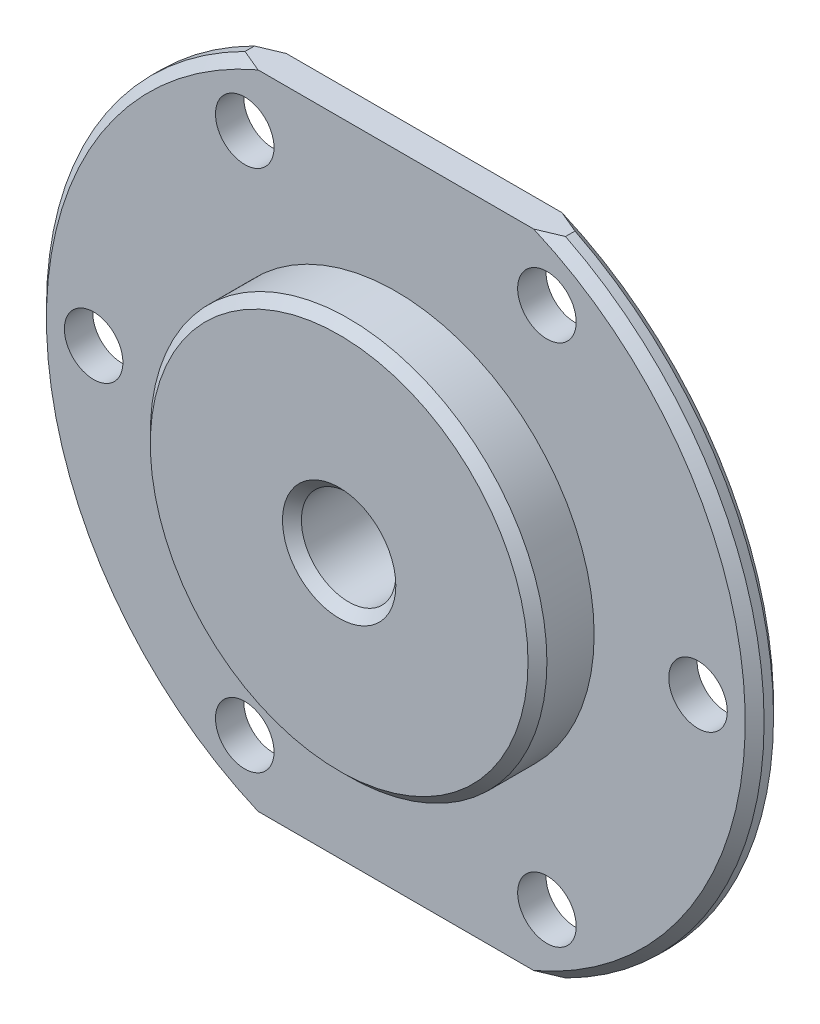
ISO-10303-21;
HEADER;
FILE_DESCRIPTION(('STEP AP214'),'2;1');
FILE_NAME('part.step','',(''),(''),'','','');
FILE_SCHEMA(('AUTOMOTIVE_DESIGN { 1 0 10303 214 1 1 1 1 }'));
ENDSEC;
DATA;
#1=APPLICATION_CONTEXT('core data for automotive mechanical design processes');
#2=APPLICATION_PROTOCOL_DEFINITION('international standard','automotive_design',2000,#1);
#3=PRODUCT_CONTEXT('',#1,'mechanical');
#4=PRODUCT('Part','Part','',(#3));
#5=PRODUCT_RELATED_PRODUCT_CATEGORY('part','',(#4));
#6=PRODUCT_DEFINITION_FORMATION('','',#4);
#7=PRODUCT_DEFINITION_CONTEXT('part definition',#1,'design');
#8=PRODUCT_DEFINITION('design','',#6,#7);
#9=PRODUCT_DEFINITION_SHAPE('','',#8);
#10=(LENGTH_UNIT() NAMED_UNIT(*) SI_UNIT(.MILLI.,.METRE.));
#11=(NAMED_UNIT(*) PLANE_ANGLE_UNIT() SI_UNIT($,.RADIAN.));
#12=(NAMED_UNIT(*) SI_UNIT($,.STERADIAN.) SOLID_ANGLE_UNIT());
#13=UNCERTAINTY_MEASURE_WITH_UNIT(LENGTH_MEASURE(1.E-05),#10,'distance_accuracy_value','');
#14=(GEOMETRIC_REPRESENTATION_CONTEXT(3) GLOBAL_UNCERTAINTY_ASSIGNED_CONTEXT((#13)) GLOBAL_UNIT_ASSIGNED_CONTEXT((#10,
#11,#12)) REPRESENTATION_CONTEXT('',''));
#15=CARTESIAN_POINT('',(0.,0.,0.));
#16=DIRECTION('',(0.,0.,1.));
#17=DIRECTION('',(1.,0.,0.));
#18=AXIS2_PLACEMENT_3D('',#15,#16,#17);
#19=CARTESIAN_POINT('',(0.,0.,1.5));
#20=DIRECTION('',(0.,0.,-1.));
#21=DIRECTION('',(-1.,0.,0.));
#22=AXIS2_PLACEMENT_3D('',#19,#20,#21);
#23=CYLINDRICAL_SURFACE('',#22,18.9998743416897);
#24=DIRECTION('',(0.,0.,-1.));
#25=VECTOR('',#24,1.);
#26=CARTESIAN_POINT('',(-8.48500000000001,17.,1.5));
#27=LINE('',#26,#25);
#28=CARTESIAN_POINT('',(-8.48500000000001,17.,1.00000000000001));
#29=VERTEX_POINT('',#28);
#30=CARTESIAN_POINT('',(-8.48500000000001,17.,0.500000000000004));
#31=VERTEX_POINT('',#30);
#32=EDGE_CURVE('E127',#29,#31,#27,.T.);
#33=ORIENTED_EDGE('',*,*,#32,.T.);
#34=CARTESIAN_POINT('',(0.,0.,0.500000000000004));
#35=DIRECTION('',(0.,0.,1.));
#36=DIRECTION('',(1.,0.,0.));
#37=AXIS2_PLACEMENT_3D('',#34,#35,#36);
#38=CIRCLE('',#37,18.9998743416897);
#39=CARTESIAN_POINT('',(-8.485,-17.,0.500000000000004));
#40=VERTEX_POINT('',#39);
#41=EDGE_CURVE('E240',#31,#40,#38,.T.);
#42=ORIENTED_EDGE('',*,*,#41,.T.);
#43=DIRECTION('',(0.,0.,-1.));
#44=VECTOR('',#43,1.);
#45=CARTESIAN_POINT('',(-8.485,-17.,1.5));
#46=LINE('',#45,#44);
#47=CARTESIAN_POINT('',(-8.485,-17.,1.00000000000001));
#48=VERTEX_POINT('',#47);
#49=EDGE_CURVE('E303',#48,#40,#46,.T.);
#50=ORIENTED_EDGE('',*,*,#49,.F.);
#51=CARTESIAN_POINT('',(0.,0.,1.00000000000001));
#52=DIRECTION('',(0.,0.,1.));
#53=DIRECTION('',(1.,0.,0.));
#54=AXIS2_PLACEMENT_3D('',#51,#52,#53);
#55=CIRCLE('',#54,18.9998743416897);
#56=EDGE_CURVE('E239',#48,#29,#55,.F.);
#57=ORIENTED_EDGE('',*,*,#56,.T.);
#58=EDGE_LOOP('',(#33,#42,#50,#57));
#59=FACE_BOUND('',#58,.T.);
#60=ADVANCED_FACE('F37',(#59),#23,.T.);
#61=CARTESIAN_POINT('',(-8.485,-17.,1.5));
#62=DIRECTION('',(0.,1.,0.));
#63=DIRECTION('',(-1.,0.,0.));
#64=AXIS2_PLACEMENT_3D('',#61,#62,#63);
#65=PLANE('',#64);
#66=DIRECTION('',(1.,0.,0.));
#67=VECTOR('',#66,1.);
#68=CARTESIAN_POINT('',(-8.485,-17.,0.));
#69=LINE('',#68,#67);
#70=CARTESIAN_POINT('',(-7.29694118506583,-17.,0.));
#71=VERTEX_POINT('',#70);
#72=CARTESIAN_POINT('',(7.29694118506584,-17.,0.));
#73=VERTEX_POINT('',#72);
#74=EDGE_CURVE('E236',#71,#73,#69,.T.);
#75=ORIENTED_EDGE('',*,*,#74,.T.);
#76=CARTESIAN_POINT('',(7.29694118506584,-17.,0.));
#77=CARTESIAN_POINT('',(7.39687946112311,-17.,0.0394189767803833));
#78=CARTESIAN_POINT('',(7.49658395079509,-17.,0.0794293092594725));
#79=CARTESIAN_POINT('',(7.69551600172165,-17.,0.160584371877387));
#80=CARTESIAN_POINT('',(7.79474361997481,-17.,0.201728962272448));
#81=CARTESIAN_POINT('',(7.99273655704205,-17.,0.285113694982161));
#82=CARTESIAN_POINT('',(8.09150187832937,-17.,0.327353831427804));
#83=CARTESIAN_POINT('',(8.28858707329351,-17.,0.412893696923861));
#84=CARTESIAN_POINT('',(8.38690689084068,-17.,0.456193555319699));
#85=CARTESIAN_POINT('',(8.48500000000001,-17.,0.499999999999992));
#86=B_SPLINE_CURVE_WITH_KNOTS('',3,(#76,#77,#78,#79,#80,#81,#82,#83,#84,#85),.UNSPECIFIED.,.F.,
.F.,(4,2,2,2,4),(0.,0.32229172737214,0.644543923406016,0.966794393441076,1.28908439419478),.UNSPECIFIED.);
#87=CARTESIAN_POINT('',(8.485,-17.,0.500000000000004));
#88=VERTEX_POINT('',#87);
#89=EDGE_CURVE('E202',#73,#88,#86,.T.);
#90=ORIENTED_EDGE('',*,*,#89,.T.);
#91=DIRECTION('',(0.,0.,-1.));
#92=VECTOR('',#91,1.);
#93=CARTESIAN_POINT('',(8.485,-17.,1.5));
#94=LINE('',#93,#92);
#95=CARTESIAN_POINT('',(8.485,-17.,1.00000000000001));
#96=VERTEX_POINT('',#95);
#97=EDGE_CURVE('E126',#96,#88,#94,.T.);
#98=ORIENTED_EDGE('',*,*,#97,.F.);
#99=CARTESIAN_POINT('',(8.485,-17.,1.00000000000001));
#100=CARTESIAN_POINT('',(8.38690689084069,-17.,1.04380644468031));
#101=CARTESIAN_POINT('',(8.28858707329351,-17.,1.08710630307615));
#102=CARTESIAN_POINT('',(8.09150187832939,-17.,1.17264616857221));
#103=CARTESIAN_POINT('',(7.99273655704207,-17.,1.21488630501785));
#104=CARTESIAN_POINT('',(7.79474361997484,-17.,1.29827103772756));
#105=CARTESIAN_POINT('',(7.69551600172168,-17.,1.33941562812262));
#106=CARTESIAN_POINT('',(7.49658395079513,-17.,1.42057069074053));
#107=CARTESIAN_POINT('',(7.39687946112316,-17.,1.46058102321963));
#108=CARTESIAN_POINT('',(7.29694118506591,-17.,1.50000000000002));
#109=B_SPLINE_CURVE_WITH_KNOTS('',3,(#99,#100,#101,#102,#103,#104,#105,#106,#107,#108),
.UNSPECIFIED.,.F.,.F.,(4,2,2,2,4),(0.,0.322290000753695,0.644540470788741,0.966792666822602,
1.28908439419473),.UNSPECIFIED.);
#110=CARTESIAN_POINT('',(7.29694118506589,-17.,1.5));
#111=VERTEX_POINT('',#110);
#112=EDGE_CURVE('E131',#96,#111,#109,.T.);
#113=ORIENTED_EDGE('',*,*,#112,.T.);
#114=DIRECTION('',(1.,0.,0.));
#115=VECTOR('',#114,1.);
#116=CARTESIAN_POINT('',(-8.485,-17.,1.5));
#117=LINE('',#116,#115);
#118=CARTESIAN_POINT('',(-7.29694118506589,-17.,1.5));
#119=VERTEX_POINT('',#118);
#120=EDGE_CURVE('E235',#119,#111,#117,.T.);
#121=ORIENTED_EDGE('',*,*,#120,.F.);
#122=CARTESIAN_POINT('',(-7.29694118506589,-17.,1.5));
#123=CARTESIAN_POINT('',(-7.39687946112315,-17.,1.46058102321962));
#124=CARTESIAN_POINT('',(-7.49658395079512,-17.,1.42057069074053));
#125=CARTESIAN_POINT('',(-7.69551600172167,-17.,1.33941562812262));
#126=CARTESIAN_POINT('',(-7.79474361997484,-17.,1.29827103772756));
#127=CARTESIAN_POINT('',(-7.99273655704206,-17.,1.21488630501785));
#128=CARTESIAN_POINT('',(-8.09150187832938,-17.,1.17264616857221));
#129=CARTESIAN_POINT('',(-8.28858707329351,-17.,1.08710630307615));
#130=CARTESIAN_POINT('',(-8.38690689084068,-17.,1.04380644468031));
#131=CARTESIAN_POINT('',(-8.485,-17.,1.00000000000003));
#132=B_SPLINE_CURVE_WITH_KNOTS('',3,(#122,#123,#124,#125,#126,#127,#128,#129,#130,#131),
.UNSPECIFIED.,.F.,.F.,(4,2,2,2,4),(0.,0.322291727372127,0.644543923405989,0.966794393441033,
1.28908439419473),.UNSPECIFIED.);
#133=EDGE_CURVE('E61',#119,#48,#132,.T.);
#134=ORIENTED_EDGE('',*,*,#133,.T.);
#135=ORIENTED_EDGE('',*,*,#49,.T.);
#136=CARTESIAN_POINT('',(-8.485,-17.,0.500000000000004));
#137=CARTESIAN_POINT('',(-8.38690689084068,-17.,0.456193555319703));
#138=CARTESIAN_POINT('',(-8.2885870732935,-17.,0.41289369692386));
#139=CARTESIAN_POINT('',(-8.09150187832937,-17.,0.327353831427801));
#140=CARTESIAN_POINT('',(-7.99273655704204,-17.,0.28511369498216));
#141=CARTESIAN_POINT('',(-7.79474361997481,-17.,0.201728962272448));
#142=CARTESIAN_POINT('',(-7.69551600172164,-17.,0.160584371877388));
#143=CARTESIAN_POINT('',(-7.49658395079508,-17.,0.079429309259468));
#144=CARTESIAN_POINT('',(-7.39687946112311,-17.,0.0394189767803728));
#145=CARTESIAN_POINT('',(-7.29694118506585,-17.,0.));
#146=B_SPLINE_CURVE_WITH_KNOTS('',3,(#136,#137,#138,#139,#140,#141,#142,#143,#144,#145),
.UNSPECIFIED.,.F.,.F.,(4,2,2,2,4),(0.,0.32229000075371,0.64454047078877,0.966792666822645,
1.28908439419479),.UNSPECIFIED.);
#147=EDGE_CURVE('E53',#40,#71,#146,.T.);
#148=ORIENTED_EDGE('',*,*,#147,.T.);
#149=EDGE_LOOP('',(#75,#90,#98,#113,#121,#134,#135,#148));
#150=FACE_BOUND('',#149,.T.);
#151=ADVANCED_FACE('F213',(#150),#65,.F.);
#152=CARTESIAN_POINT('',(0.,0.,1.5));
#153=DIRECTION('',(0.,0.,-1.));
#154=DIRECTION('',(-1.,0.,0.));
#155=AXIS2_PLACEMENT_3D('',#152,#153,#154);
#156=CYLINDRICAL_SURFACE('',#155,18.9998743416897);
#157=ORIENTED_EDGE('',*,*,#97,.T.);
#158=CARTESIAN_POINT('',(0.,0.,0.500000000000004));
#159=DIRECTION('',(0.,0.,1.));
#160=DIRECTION('',(1.,0.,0.));
#161=AXIS2_PLACEMENT_3D('',#158,#159,#160);
#162=CIRCLE('',#161,18.9998743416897);
#163=CARTESIAN_POINT('',(8.485,17.,0.500000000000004));
#164=VERTEX_POINT('',#163);
#165=EDGE_CURVE('E125',#88,#164,#162,.T.);
#166=ORIENTED_EDGE('',*,*,#165,.T.);
#167=DIRECTION('',(0.,0.,-1.));
#168=VECTOR('',#167,1.);
#169=CARTESIAN_POINT('',(8.485,17.,1.5));
#170=LINE('',#169,#168);
#171=CARTESIAN_POINT('',(8.485,17.,1.00000000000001));
#172=VERTEX_POINT('',#171);
#173=EDGE_CURVE('E108',#172,#164,#170,.T.);
#174=ORIENTED_EDGE('',*,*,#173,.F.);
#175=CARTESIAN_POINT('',(0.,0.,1.00000000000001));
#176=DIRECTION('',(0.,0.,1.));
#177=DIRECTION('',(1.,0.,0.));
#178=AXIS2_PLACEMENT_3D('',#175,#176,#177);
#179=CIRCLE('',#178,18.9998743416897);
#180=EDGE_CURVE('E122',#172,#96,#179,.F.);
#181=ORIENTED_EDGE('',*,*,#180,.T.);
#182=EDGE_LOOP('',(#157,#166,#174,#181));
#183=FACE_BOUND('',#182,.T.);
#184=ADVANCED_FACE('F121',(#183),#156,.T.);
#185=CARTESIAN_POINT('',(-8.48500000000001,17.,1.5));
#186=DIRECTION('',(0.,-1.,0.));
#187=DIRECTION('',(1.,0.,0.));
#188=AXIS2_PLACEMENT_3D('',#185,#186,#187);
#189=PLANE('',#188);
#190=ORIENTED_EDGE('',*,*,#173,.T.);
#191=CARTESIAN_POINT('',(8.485,17.,0.500000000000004));
#192=CARTESIAN_POINT('',(8.38690689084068,17.,0.456193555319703));
#193=CARTESIAN_POINT('',(8.28858707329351,17.,0.41289369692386));
#194=CARTESIAN_POINT('',(8.09150187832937,17.,0.327353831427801));
#195=CARTESIAN_POINT('',(7.99273655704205,17.,0.28511369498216));
#196=CARTESIAN_POINT('',(7.79474361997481,17.,0.201728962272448));
#197=CARTESIAN_POINT('',(7.69551600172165,17.,0.160584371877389));
#198=CARTESIAN_POINT('',(7.49658395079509,17.,0.079429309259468));
#199=CARTESIAN_POINT('',(7.39687946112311,17.,0.0394189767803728));
#200=CARTESIAN_POINT('',(7.29694118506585,17.,0.));
#201=B_SPLINE_CURVE_WITH_KNOTS('',3,(#191,#192,#193,#194,#195,#196,#197,#198,#199,#200),
.UNSPECIFIED.,.F.,.F.,(4,2,2,2,4),(0.,0.32229000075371,0.64454047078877,0.966792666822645,
1.28908439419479),.UNSPECIFIED.);
#202=CARTESIAN_POINT('',(7.29694118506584,17.,0.));
#203=VERTEX_POINT('',#202);
#204=EDGE_CURVE('E175',#164,#203,#201,.T.);
#205=ORIENTED_EDGE('',*,*,#204,.T.);
#206=DIRECTION('',(-1.,0.,0.));
#207=VECTOR('',#206,1.);
#208=CARTESIAN_POINT('',(-8.48500000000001,17.,0.));
#209=LINE('',#208,#207);
#210=CARTESIAN_POINT('',(-7.29694118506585,17.,0.));
#211=VERTEX_POINT('',#210);
#212=EDGE_CURVE('E230',#203,#211,#209,.T.);
#213=ORIENTED_EDGE('',*,*,#212,.T.);
#214=CARTESIAN_POINT('',(-7.29694118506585,17.,0.));
#215=CARTESIAN_POINT('',(-7.39687946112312,17.,0.0394189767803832));
#216=CARTESIAN_POINT('',(-7.49658395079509,17.,0.0794293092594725));
#217=CARTESIAN_POINT('',(-7.69551600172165,17.,0.160584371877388));
#218=CARTESIAN_POINT('',(-7.79474361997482,17.,0.201728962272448));
#219=CARTESIAN_POINT('',(-7.99273655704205,17.,0.285113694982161));
#220=CARTESIAN_POINT('',(-8.09150187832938,17.,0.327353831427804));
#221=CARTESIAN_POINT('',(-8.28858707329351,17.,0.412893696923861));
#222=CARTESIAN_POINT('',(-8.38690689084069,17.,0.456193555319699));
#223=CARTESIAN_POINT('',(-8.48500000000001,17.,0.499999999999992));
#224=B_SPLINE_CURVE_WITH_KNOTS('',3,(#214,#215,#216,#217,#218,#219,#220,#221,#222,#223),
.UNSPECIFIED.,.F.,.F.,(4,2,2,2,4),(0.,0.32229172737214,0.644543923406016,0.966794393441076,
1.28908439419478),.UNSPECIFIED.);
#225=EDGE_CURVE('E115',#211,#31,#224,.T.);
#226=ORIENTED_EDGE('',*,*,#225,.T.);
#227=ORIENTED_EDGE('',*,*,#32,.F.);
#228=CARTESIAN_POINT('',(-8.48500000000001,17.,1.00000000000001));
#229=CARTESIAN_POINT('',(-8.38690689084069,17.,1.04380644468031));
#230=CARTESIAN_POINT('',(-8.28858707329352,17.,1.08710630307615));
#231=CARTESIAN_POINT('',(-8.09150187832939,17.,1.17264616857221));
#232=CARTESIAN_POINT('',(-7.99273655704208,17.,1.21488630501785));
#233=CARTESIAN_POINT('',(-7.79474361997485,17.,1.29827103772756));
#234=CARTESIAN_POINT('',(-7.69551600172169,17.,1.33941562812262));
#235=CARTESIAN_POINT('',(-7.49658395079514,17.,1.42057069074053));
#236=CARTESIAN_POINT('',(-7.39687946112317,17.,1.46058102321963));
#237=CARTESIAN_POINT('',(-7.29694118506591,17.,1.50000000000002));
#238=B_SPLINE_CURVE_WITH_KNOTS('',3,(#228,#229,#230,#231,#232,#233,#234,#235,#236,#237),
.UNSPECIFIED.,.F.,.F.,(4,2,2,2,4),(0.,0.322290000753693,0.644540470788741,0.966792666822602,
1.28908439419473),.UNSPECIFIED.);
#239=CARTESIAN_POINT('',(-7.2969411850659,17.,1.5));
#240=VERTEX_POINT('',#239);
#241=EDGE_CURVE('E116',#29,#240,#238,.T.);
#242=ORIENTED_EDGE('',*,*,#241,.T.);
#243=DIRECTION('',(-1.,0.,0.));
#244=VECTOR('',#243,1.);
#245=CARTESIAN_POINT('',(-8.48500000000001,17.,1.5));
#246=LINE('',#245,#244);
#247=CARTESIAN_POINT('',(7.29694118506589,17.,1.5));
#248=VERTEX_POINT('',#247);
#249=EDGE_CURVE('E110',#248,#240,#246,.T.);
#250=ORIENTED_EDGE('',*,*,#249,.F.);
#251=CARTESIAN_POINT('',(7.2969411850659,17.,1.5));
#252=CARTESIAN_POINT('',(7.39687946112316,17.,1.46058102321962));
#253=CARTESIAN_POINT('',(7.49658395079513,17.,1.42057069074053));
#254=CARTESIAN_POINT('',(7.69551600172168,17.,1.33941562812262));
#255=CARTESIAN_POINT('',(7.79474361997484,17.,1.29827103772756));
#256=CARTESIAN_POINT('',(7.99273655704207,17.,1.21488630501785));
#257=CARTESIAN_POINT('',(8.09150187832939,17.,1.17264616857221));
#258=CARTESIAN_POINT('',(8.28858707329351,17.,1.08710630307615));
#259=CARTESIAN_POINT('',(8.38690689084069,17.,1.04380644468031));
#260=CARTESIAN_POINT('',(8.48500000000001,17.,1.00000000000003));
#261=B_SPLINE_CURVE_WITH_KNOTS('',3,(#251,#252,#253,#254,#255,#256,#257,#258,#259,#260),
.UNSPECIFIED.,.F.,.F.,(4,2,2,2,4),(0.,0.322291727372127,0.644543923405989,0.966794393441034,
1.28908439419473),.UNSPECIFIED.);
#262=EDGE_CURVE('E105',#248,#172,#261,.T.);
#263=ORIENTED_EDGE('',*,*,#262,.T.);
#264=EDGE_LOOP('',(#190,#205,#213,#226,#227,#242,#250,#263));
#265=FACE_BOUND('',#264,.T.);
#266=ADVANCED_FACE('F107',(#265),#189,.F.);
#267=CARTESIAN_POINT('',(0.,0.,1.5));
#268=DIRECTION('',(0.,0.,1.));
#269=DIRECTION('',(1.,0.,0.));
#270=AXIS2_PLACEMENT_3D('',#267,#268,#269);
#271=PLANE('',#270);
#272=CARTESIAN_POINT('',(-16.,0.,1.5));
#273=DIRECTION('',(0.,0.,1.));
#274=DIRECTION('',(1.,0.,0.));
#275=AXIS2_PLACEMENT_3D('',#272,#273,#274);
#276=CIRCLE('',#275,1.55);
#277=CARTESIAN_POINT('',(-14.45,0.,1.5));
#278=VERTEX_POINT('',#277);
#279=EDGE_CURVE('E309',#278,#278,#276,.T.);
#280=ORIENTED_EDGE('',*,*,#279,.F.);
#281=EDGE_LOOP('',(#280));
#282=FACE_BOUND('',#281,.T.);
#283=CARTESIAN_POINT('',(-8.00000000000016,-13.8564064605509,1.5));
#284=DIRECTION('',(0.,0.,1.));
#285=DIRECTION('',(1.,0.,0.));
#286=AXIS2_PLACEMENT_3D('',#283,#284,#285);
#287=CIRCLE('',#286,1.55);
#288=CARTESIAN_POINT('',(-6.45000000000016,-13.8564064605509,1.5));
#289=VERTEX_POINT('',#288);
#290=EDGE_CURVE('E333',#289,#289,#287,.T.);
#291=ORIENTED_EDGE('',*,*,#290,.F.);
#292=EDGE_LOOP('',(#291));
#293=FACE_BOUND('',#292,.T.);
#294=CARTESIAN_POINT('',(7.99999999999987,-13.8564064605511,1.5));
#295=DIRECTION('',(0.,0.,1.));
#296=DIRECTION('',(1.,0.,0.));
#297=AXIS2_PLACEMENT_3D('',#294,#295,#296);
#298=CIRCLE('',#297,1.55);
#299=CARTESIAN_POINT('',(9.54999999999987,-13.8564064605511,1.5));
#300=VERTEX_POINT('',#299);
#301=EDGE_CURVE('E329',#300,#300,#298,.T.);
#302=ORIENTED_EDGE('',*,*,#301,.F.);
#303=EDGE_LOOP('',(#302));
#304=FACE_BOUND('',#303,.T.);
#305=CARTESIAN_POINT('',(16.,-1.1172740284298E-13,1.5));
#306=DIRECTION('',(0.,0.,1.));
#307=DIRECTION('',(1.,0.,0.));
#308=AXIS2_PLACEMENT_3D('',#305,#306,#307);
#309=CIRCLE('',#308,1.55);
#310=CARTESIAN_POINT('',(17.55,-1.1172740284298E-13,1.5));
#311=VERTEX_POINT('',#310);
#312=EDGE_CURVE('E332',#311,#311,#309,.T.);
#313=ORIENTED_EDGE('',*,*,#312,.F.);
#314=EDGE_LOOP('',(#313));
#315=FACE_BOUND('',#314,.T.);
#316=CARTESIAN_POINT('',(8.00000000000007,13.856406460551,1.5));
#317=DIRECTION('',(0.,0.,1.));
#318=DIRECTION('',(1.,0.,0.));
#319=AXIS2_PLACEMENT_3D('',#316,#317,#318);
#320=CIRCLE('',#319,1.55);
#321=CARTESIAN_POINT('',(9.55000000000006,13.856406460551,1.5));
#322=VERTEX_POINT('',#321);
#323=EDGE_CURVE('E336',#322,#322,#320,.T.);
#324=ORIENTED_EDGE('',*,*,#323,.F.);
#325=EDGE_LOOP('',(#324));
#326=FACE_BOUND('',#325,.T.);
#327=CARTESIAN_POINT('',(-7.99999999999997,13.856406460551,1.5));
#328=DIRECTION('',(0.,0.,1.));
#329=DIRECTION('',(1.,0.,0.));
#330=AXIS2_PLACEMENT_3D('',#327,#328,#329);
#331=CIRCLE('',#330,1.55);
#332=CARTESIAN_POINT('',(-6.44999999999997,13.856406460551,1.5));
#333=VERTEX_POINT('',#332);
#334=EDGE_CURVE('E339',#333,#333,#331,.T.);
#335=ORIENTED_EDGE('',*,*,#334,.F.);
#336=EDGE_LOOP('',(#335));
#337=FACE_BOUND('',#336,.T.);
#338=CARTESIAN_POINT('',(0.,0.,1.5));
#339=DIRECTION('',(0.,0.,1.));
#340=DIRECTION('',(1.,0.,0.));
#341=AXIS2_PLACEMENT_3D('',#338,#339,#340);
#342=CIRCLE('',#341,10.5);
#343=CARTESIAN_POINT('',(10.5,0.,1.5));
#344=VERTEX_POINT('',#343);
#345=EDGE_CURVE('E136',#344,#344,#342,.T.);
#346=ORIENTED_EDGE('',*,*,#345,.F.);
#347=EDGE_LOOP('',(#346));
#348=FACE_BOUND('',#347,.T.);
#349=ORIENTED_EDGE('',*,*,#120,.T.);
#350=CARTESIAN_POINT('',(0.,0.,1.5));
#351=DIRECTION('',(0.,0.,1.));
#352=DIRECTION('',(1.,0.,0.));
#353=AXIS2_PLACEMENT_3D('',#350,#351,#352);
#354=CIRCLE('',#353,18.4998743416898);
#355=EDGE_CURVE('E250',#111,#248,#354,.T.);
#356=ORIENTED_EDGE('',*,*,#355,.T.);
#357=ORIENTED_EDGE('',*,*,#249,.T.);
#358=CARTESIAN_POINT('',(0.,0.,1.5));
#359=DIRECTION('',(0.,0.,1.));
#360=DIRECTION('',(1.,0.,0.));
#361=AXIS2_PLACEMENT_3D('',#358,#359,#360);
#362=CIRCLE('',#361,18.4998743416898);
#363=EDGE_CURVE('E245',#240,#119,#362,.T.);
#364=ORIENTED_EDGE('',*,*,#363,.T.);
#365=EDGE_LOOP('',(#349,#356,#357,#364));
#366=FACE_BOUND('',#365,.T.);
#367=ADVANCED_FACE('F162',(#282,#293,#304,#315,#326,#337,#348,#366),#271,.T.);
#368=CARTESIAN_POINT('',(0.,0.,0.));
#369=DIRECTION('',(0.,0.,1.));
#370=DIRECTION('',(1.,0.,0.));
#371=AXIS2_PLACEMENT_3D('',#368,#369,#370);
#372=PLANE('',#371);
#373=CARTESIAN_POINT('',(-16.,0.,0.));
#374=DIRECTION('',(0.,0.,1.));
#375=DIRECTION('',(1.,0.,0.));
#376=AXIS2_PLACEMENT_3D('',#373,#374,#375);
#377=CIRCLE('',#376,1.55);
#378=CARTESIAN_POINT('',(-14.45,0.,0.));
#379=VERTEX_POINT('',#378);
#380=EDGE_CURVE('E139',#379,#379,#377,.T.);
#381=ORIENTED_EDGE('',*,*,#380,.T.);
#382=EDGE_LOOP('',(#381));
#383=FACE_BOUND('',#382,.T.);
#384=CARTESIAN_POINT('',(-8.00000000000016,-13.8564064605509,0.));
#385=DIRECTION('',(0.,0.,1.));
#386=DIRECTION('',(1.,0.,0.));
#387=AXIS2_PLACEMENT_3D('',#384,#385,#386);
#388=CIRCLE('',#387,1.55);
#389=CARTESIAN_POINT('',(-6.45000000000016,-13.8564064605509,0.));
#390=VERTEX_POINT('',#389);
#391=EDGE_CURVE('E317',#390,#390,#388,.T.);
#392=ORIENTED_EDGE('',*,*,#391,.T.);
#393=EDGE_LOOP('',(#392));
#394=FACE_BOUND('',#393,.T.);
#395=CARTESIAN_POINT('',(7.99999999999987,-13.8564064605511,0.));
#396=DIRECTION('',(0.,0.,1.));
#397=DIRECTION('',(1.,0.,0.));
#398=AXIS2_PLACEMENT_3D('',#395,#396,#397);
#399=CIRCLE('',#398,1.55);
#400=CARTESIAN_POINT('',(9.54999999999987,-13.8564064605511,0.));
#401=VERTEX_POINT('',#400);
#402=EDGE_CURVE('E315',#401,#401,#399,.T.);
#403=ORIENTED_EDGE('',*,*,#402,.T.);
#404=EDGE_LOOP('',(#403));
#405=FACE_BOUND('',#404,.T.);
#406=CARTESIAN_POINT('',(16.,-1.1172740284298E-13,0.));
#407=DIRECTION('',(0.,0.,1.));
#408=DIRECTION('',(1.,0.,0.));
#409=AXIS2_PLACEMENT_3D('',#406,#407,#408);
#410=CIRCLE('',#409,1.55);
#411=CARTESIAN_POINT('',(17.55,-1.1172740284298E-13,0.));
#412=VERTEX_POINT('',#411);
#413=EDGE_CURVE('E312',#412,#412,#410,.T.);
#414=ORIENTED_EDGE('',*,*,#413,.T.);
#415=EDGE_LOOP('',(#414));
#416=FACE_BOUND('',#415,.T.);
#417=CARTESIAN_POINT('',(8.00000000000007,13.856406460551,0.));
#418=DIRECTION('',(0.,0.,1.));
#419=DIRECTION('',(1.,0.,0.));
#420=AXIS2_PLACEMENT_3D('',#417,#418,#419);
#421=CIRCLE('',#420,1.55);
#422=CARTESIAN_POINT('',(9.55000000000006,13.856406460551,0.));
#423=VERTEX_POINT('',#422);
#424=EDGE_CURVE('E308',#423,#423,#421,.T.);
#425=ORIENTED_EDGE('',*,*,#424,.T.);
#426=EDGE_LOOP('',(#425));
#427=FACE_BOUND('',#426,.T.);
#428=CARTESIAN_POINT('',(-7.99999999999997,13.856406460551,0.));
#429=DIRECTION('',(0.,0.,1.));
#430=DIRECTION('',(1.,0.,0.));
#431=AXIS2_PLACEMENT_3D('',#428,#429,#430);
#432=CIRCLE('',#431,1.55);
#433=CARTESIAN_POINT('',(-6.44999999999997,13.856406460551,0.));
#434=VERTEX_POINT('',#433);
#435=EDGE_CURVE('E305',#434,#434,#432,.T.);
#436=ORIENTED_EDGE('',*,*,#435,.T.);
#437=EDGE_LOOP('',(#436));
#438=FACE_BOUND('',#437,.T.);
#439=CARTESIAN_POINT('',(0.,0.,0.));
#440=DIRECTION('',(0.,0.,1.));
#441=DIRECTION('',(1.,0.,0.));
#442=AXIS2_PLACEMENT_3D('',#439,#440,#441);
#443=CIRCLE('',#442,5.);
#444=CARTESIAN_POINT('',(5.,0.,0.));
#445=VERTEX_POINT('',#444);
#446=EDGE_CURVE('E132',#445,#445,#443,.F.);
#447=ORIENTED_EDGE('',*,*,#446,.F.);
#448=EDGE_LOOP('',(#447));
#449=FACE_BOUND('',#448,.T.);
#450=ORIENTED_EDGE('',*,*,#212,.F.);
#451=CARTESIAN_POINT('',(0.,0.,0.));
#452=DIRECTION('',(0.,0.,1.));
#453=DIRECTION('',(1.,0.,0.));
#454=AXIS2_PLACEMENT_3D('',#451,#452,#453);
#455=CIRCLE('',#454,18.4998743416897);
#456=EDGE_CURVE('E224',#203,#73,#455,.F.);
#457=ORIENTED_EDGE('',*,*,#456,.T.);
#458=ORIENTED_EDGE('',*,*,#74,.F.);
#459=CARTESIAN_POINT('',(0.,0.,0.));
#460=DIRECTION('',(0.,0.,1.));
#461=DIRECTION('',(1.,0.,0.));
#462=AXIS2_PLACEMENT_3D('',#459,#460,#461);
#463=CIRCLE('',#462,18.4998743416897);
#464=EDGE_CURVE('E225',#71,#211,#463,.F.);
#465=ORIENTED_EDGE('',*,*,#464,.T.);
#466=EDGE_LOOP('',(#450,#457,#458,#465));
#467=FACE_BOUND('',#466,.T.);
#468=ADVANCED_FACE('F163',(#383,#394,#405,#416,#427,#438,#449,#467),#372,.F.);
#469=CARTESIAN_POINT('',(0.,0.,4.5));
#470=DIRECTION('',(0.,0.,-1.));
#471=DIRECTION('',(-1.,0.,0.));
#472=AXIS2_PLACEMENT_3D('',#469,#470,#471);
#473=CYLINDRICAL_SURFACE('',#472,10.5);
#474=CARTESIAN_POINT('',(0.,0.,4.));
#475=DIRECTION('',(0.,0.,1.));
#476=DIRECTION('',(1.,0.,0.));
#477=AXIS2_PLACEMENT_3D('',#474,#475,#476);
#478=CIRCLE('',#477,10.5);
#479=CARTESIAN_POINT('',(10.5,0.,4.));
#480=VERTEX_POINT('',#479);
#481=EDGE_CURVE('E258',#480,#480,#478,.F.);
#482=ORIENTED_EDGE('',*,*,#481,.T.);
#483=EDGE_LOOP('',(#482));
#484=FACE_BOUND('',#483,.T.);
#485=ORIENTED_EDGE('',*,*,#345,.T.);
#486=EDGE_LOOP('',(#485));
#487=FACE_BOUND('',#486,.T.);
#488=ADVANCED_FACE('F455',(#484,#487),#473,.T.);
#489=CARTESIAN_POINT('',(0.,0.,4.5));
#490=DIRECTION('',(0.,0.,1.));
#491=DIRECTION('',(1.,0.,0.));
#492=AXIS2_PLACEMENT_3D('',#489,#490,#491);
#493=PLANE('',#492);
#494=CARTESIAN_POINT('',(0.,0.,4.5));
#495=DIRECTION('',(0.,0.,1.));
#496=DIRECTION('',(1.,0.,0.));
#497=AXIS2_PLACEMENT_3D('',#494,#495,#496);
#498=CIRCLE('',#497,10.);
#499=CARTESIAN_POINT('',(10.,0.,4.5));
#500=VERTEX_POINT('',#499);
#501=EDGE_CURVE('E255',#500,#500,#498,.T.);
#502=ORIENTED_EDGE('',*,*,#501,.T.);
#503=EDGE_LOOP('',(#502));
#504=FACE_BOUND('',#503,.T.);
#505=CARTESIAN_POINT('',(0.,0.,4.5));
#506=DIRECTION('',(0.,0.,1.));
#507=DIRECTION('',(1.,0.,0.));
#508=AXIS2_PLACEMENT_3D('',#505,#506,#507);
#509=CIRCLE('',#508,3.);
#510=CARTESIAN_POINT('',(3.,0.,4.5));
#511=VERTEX_POINT('',#510);
#512=EDGE_CURVE('E252',#511,#511,#509,.F.);
#513=ORIENTED_EDGE('',*,*,#512,.T.);
#514=EDGE_LOOP('',(#513));
#515=FACE_BOUND('',#514,.T.);
#516=ADVANCED_FACE('F448',(#504,#515),#493,.T.);
#517=CARTESIAN_POINT('',(0.,0.,-5.5));
#518=DIRECTION('',(0.,0.,1.));
#519=DIRECTION('',(1.,0.,0.));
#520=AXIS2_PLACEMENT_3D('',#517,#518,#519);
#521=CYLINDRICAL_SURFACE('',#520,2.5);
#522=CARTESIAN_POINT('',(0.,0.,-4.50000000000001));
#523=DIRECTION('',(0.,0.,-1.));
#524=DIRECTION('',(-1.,0.,0.));
#525=AXIS2_PLACEMENT_3D('',#522,#523,#524);
#526=CIRCLE('',#525,2.5);
#527=CARTESIAN_POINT('',(-2.5,0.,-4.50000000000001));
#528=VERTEX_POINT('',#527);
#529=EDGE_CURVE('E46',#528,#528,#526,.T.);
#530=ORIENTED_EDGE('',*,*,#529,.T.);
#531=EDGE_LOOP('',(#530));
#532=FACE_BOUND('',#531,.T.);
#533=CARTESIAN_POINT('',(0.,0.,4.));
#534=DIRECTION('',(0.,0.,1.));
#535=DIRECTION('',(1.,0.,0.));
#536=AXIS2_PLACEMENT_3D('',#533,#534,#535);
#537=CIRCLE('',#536,2.5);
#538=CARTESIAN_POINT('',(2.5,0.,4.));
#539=VERTEX_POINT('',#538);
#540=EDGE_CURVE('E261',#539,#539,#537,.T.);
#541=ORIENTED_EDGE('',*,*,#540,.T.);
#542=EDGE_LOOP('',(#541));
#543=FACE_BOUND('',#542,.T.);
#544=ADVANCED_FACE('F272',(#532,#543),#521,.F.);
#545=CARTESIAN_POINT('',(0.,0.,-5.));
#546=DIRECTION('',(0.,0.,1.));
#547=DIRECTION('',(1.,0.,0.));
#548=AXIS2_PLACEMENT_3D('',#545,#546,#547);
#549=CYLINDRICAL_SURFACE('',#548,5.);
#550=CARTESIAN_POINT('',(0.,0.,-4.5));
#551=DIRECTION('',(0.,0.,-1.));
#552=DIRECTION('',(-1.,0.,0.));
#553=AXIS2_PLACEMENT_3D('',#550,#551,#552);
#554=CIRCLE('',#553,5.);
#555=CARTESIAN_POINT('',(-5.,0.,-4.5));
#556=VERTEX_POINT('',#555);
#557=EDGE_CURVE('E11',#556,#556,#554,.F.);
#558=ORIENTED_EDGE('',*,*,#557,.T.);
#559=EDGE_LOOP('',(#558));
#560=FACE_BOUND('',#559,.T.);
#561=ORIENTED_EDGE('',*,*,#446,.T.);
#562=EDGE_LOOP('',(#561));
#563=FACE_BOUND('',#562,.T.);
#564=ADVANCED_FACE('F285',(#560,#563),#549,.T.);
#565=CARTESIAN_POINT('',(0.,0.,-5.));
#566=DIRECTION('',(0.,0.,-1.));
#567=DIRECTION('',(-1.,0.,0.));
#568=AXIS2_PLACEMENT_3D('',#565,#566,#567);
#569=PLANE('',#568);
#570=CARTESIAN_POINT('',(0.,0.,-5.));
#571=DIRECTION('',(0.,0.,-1.));
#572=DIRECTION('',(-1.,0.,0.));
#573=AXIS2_PLACEMENT_3D('',#570,#571,#572);
#574=CIRCLE('',#573,3.);
#575=CARTESIAN_POINT('',(-3.,0.,-5.));
#576=VERTEX_POINT('',#575);
#577=EDGE_CURVE('E267',#576,#576,#574,.F.);
#578=ORIENTED_EDGE('',*,*,#577,.T.);
#579=EDGE_LOOP('',(#578));
#580=FACE_BOUND('',#579,.T.);
#581=CARTESIAN_POINT('',(0.,0.,-5.));
#582=DIRECTION('',(0.,0.,-1.));
#583=DIRECTION('',(-1.,0.,0.));
#584=AXIS2_PLACEMENT_3D('',#581,#582,#583);
#585=CIRCLE('',#584,4.5);
#586=CARTESIAN_POINT('',(-4.5,0.,-5.));
#587=VERTEX_POINT('',#586);
#588=EDGE_CURVE('E264',#587,#587,#585,.T.);
#589=ORIENTED_EDGE('',*,*,#588,.T.);
#590=EDGE_LOOP('',(#589));
#591=FACE_BOUND('',#590,.T.);
#592=ADVANCED_FACE('F281',(#580,#591),#569,.T.);
#593=CARTESIAN_POINT('',(-7.99999999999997,13.856406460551,-3.5));
#594=DIRECTION('',(0.,0.,1.));
#595=DIRECTION('',(1.,0.,0.));
#596=AXIS2_PLACEMENT_3D('',#593,#594,#595);
#597=CYLINDRICAL_SURFACE('',#596,1.55);
#598=ORIENTED_EDGE('',*,*,#334,.T.);
#599=EDGE_LOOP('',(#598));
#600=FACE_BOUND('',#599,.T.);
#601=ORIENTED_EDGE('',*,*,#435,.F.);
#602=EDGE_LOOP('',(#601));
#603=FACE_BOUND('',#602,.T.);
#604=ADVANCED_FACE('F284',(#600,#603),#597,.F.);
#605=CARTESIAN_POINT('',(8.00000000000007,13.856406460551,-3.5));
#606=DIRECTION('',(0.,0.,1.));
#607=DIRECTION('',(1.,0.,0.));
#608=AXIS2_PLACEMENT_3D('',#605,#606,#607);
#609=CYLINDRICAL_SURFACE('',#608,1.55);
#610=ORIENTED_EDGE('',*,*,#323,.T.);
#611=EDGE_LOOP('',(#610));
#612=FACE_BOUND('',#611,.T.);
#613=ORIENTED_EDGE('',*,*,#424,.F.);
#614=EDGE_LOOP('',(#613));
#615=FACE_BOUND('',#614,.T.);
#616=ADVANCED_FACE('F414',(#612,#615),#609,.F.);
#617=CARTESIAN_POINT('',(16.,-1.1172740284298E-13,-3.5));
#618=DIRECTION('',(0.,0.,1.));
#619=DIRECTION('',(1.,0.,0.));
#620=AXIS2_PLACEMENT_3D('',#617,#618,#619);
#621=CYLINDRICAL_SURFACE('',#620,1.55);
#622=ORIENTED_EDGE('',*,*,#312,.T.);
#623=EDGE_LOOP('',(#622));
#624=FACE_BOUND('',#623,.T.);
#625=ORIENTED_EDGE('',*,*,#413,.F.);
#626=EDGE_LOOP('',(#625));
#627=FACE_BOUND('',#626,.T.);
#628=ADVANCED_FACE('F406',(#624,#627),#621,.F.);
#629=CARTESIAN_POINT('',(7.99999999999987,-13.8564064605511,-3.5));
#630=DIRECTION('',(0.,0.,1.));
#631=DIRECTION('',(1.,0.,0.));
#632=AXIS2_PLACEMENT_3D('',#629,#630,#631);
#633=CYLINDRICAL_SURFACE('',#632,1.55);
#634=ORIENTED_EDGE('',*,*,#301,.T.);
#635=EDGE_LOOP('',(#634));
#636=FACE_BOUND('',#635,.T.);
#637=ORIENTED_EDGE('',*,*,#402,.F.);
#638=EDGE_LOOP('',(#637));
#639=FACE_BOUND('',#638,.T.);
#640=ADVANCED_FACE('F398',(#636,#639),#633,.F.);
#641=CARTESIAN_POINT('',(-8.00000000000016,-13.8564064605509,-3.5));
#642=DIRECTION('',(0.,0.,1.));
#643=DIRECTION('',(1.,0.,0.));
#644=AXIS2_PLACEMENT_3D('',#641,#642,#643);
#645=CYLINDRICAL_SURFACE('',#644,1.55);
#646=ORIENTED_EDGE('',*,*,#290,.T.);
#647=EDGE_LOOP('',(#646));
#648=FACE_BOUND('',#647,.T.);
#649=ORIENTED_EDGE('',*,*,#391,.F.);
#650=EDGE_LOOP('',(#649));
#651=FACE_BOUND('',#650,.T.);
#652=ADVANCED_FACE('F391',(#648,#651),#645,.F.);
#653=CARTESIAN_POINT('',(-16.,0.,-3.5));
#654=DIRECTION('',(0.,0.,1.));
#655=DIRECTION('',(1.,0.,0.));
#656=AXIS2_PLACEMENT_3D('',#653,#654,#655);
#657=CYLINDRICAL_SURFACE('',#656,1.55);
#658=ORIENTED_EDGE('',*,*,#279,.T.);
#659=EDGE_LOOP('',(#658));
#660=FACE_BOUND('',#659,.T.);
#661=ORIENTED_EDGE('',*,*,#380,.F.);
#662=EDGE_LOOP('',(#661));
#663=FACE_BOUND('',#662,.T.);
#664=ADVANCED_FACE('F347',(#660,#663),#657,.F.);
#665=CARTESIAN_POINT('',(0.,0.,0.500000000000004));
#666=DIRECTION('',(0.,0.,1.));
#667=DIRECTION('',(1.,0.,0.));
#668=AXIS2_PLACEMENT_3D('',#665,#666,#667);
#669=CONICAL_SURFACE('',#668,18.9998743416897,0.785398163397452);
#670=ORIENTED_EDGE('',*,*,#89,.F.);
#671=ORIENTED_EDGE('',*,*,#456,.F.);
#672=ORIENTED_EDGE('',*,*,#204,.F.);
#673=ORIENTED_EDGE('',*,*,#165,.F.);
#674=EDGE_LOOP('',(#670,#671,#672,#673));
#675=FACE_BOUND('',#674,.T.);
#676=ADVANCED_FACE('F190',(#675),#669,.T.);
#677=CARTESIAN_POINT('',(0.,0.,0.500000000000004));
#678=DIRECTION('',(0.,0.,1.));
#679=DIRECTION('',(1.,0.,0.));
#680=AXIS2_PLACEMENT_3D('',#677,#678,#679);
#681=CONICAL_SURFACE('',#680,18.9998743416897,0.785398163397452);
#682=ORIENTED_EDGE('',*,*,#225,.F.);
#683=ORIENTED_EDGE('',*,*,#464,.F.);
#684=ORIENTED_EDGE('',*,*,#147,.F.);
#685=ORIENTED_EDGE('',*,*,#41,.F.);
#686=EDGE_LOOP('',(#682,#683,#684,#685));
#687=FACE_BOUND('',#686,.T.);
#688=ADVANCED_FACE('F183',(#687),#681,.T.);
#689=CARTESIAN_POINT('',(0.,0.,1.5));
#690=DIRECTION('',(0.,0.,-1.));
#691=DIRECTION('',(-1.,0.,0.));
#692=AXIS2_PLACEMENT_3D('',#689,#690,#691);
#693=CONICAL_SURFACE('',#692,18.4998743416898,0.785398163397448);
#694=ORIENTED_EDGE('',*,*,#112,.F.);
#695=ORIENTED_EDGE('',*,*,#180,.F.);
#696=ORIENTED_EDGE('',*,*,#262,.F.);
#697=ORIENTED_EDGE('',*,*,#355,.F.);
#698=EDGE_LOOP('',(#694,#695,#696,#697));
#699=FACE_BOUND('',#698,.T.);
#700=ADVANCED_FACE('F130',(#699),#693,.T.);
#701=CARTESIAN_POINT('',(0.,0.,1.5));
#702=DIRECTION('',(0.,0.,-1.));
#703=DIRECTION('',(-1.,0.,0.));
#704=AXIS2_PLACEMENT_3D('',#701,#702,#703);
#705=CONICAL_SURFACE('',#704,18.4998743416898,0.785398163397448);
#706=ORIENTED_EDGE('',*,*,#241,.F.);
#707=ORIENTED_EDGE('',*,*,#56,.F.);
#708=ORIENTED_EDGE('',*,*,#133,.F.);
#709=ORIENTED_EDGE('',*,*,#363,.F.);
#710=EDGE_LOOP('',(#706,#707,#708,#709));
#711=FACE_BOUND('',#710,.T.);
#712=ADVANCED_FACE('F155',(#711),#705,.T.);
#713=CARTESIAN_POINT('',(0.,0.,4.5));
#714=DIRECTION('',(0.,0.,-1.));
#715=DIRECTION('',(-1.,0.,0.));
#716=AXIS2_PLACEMENT_3D('',#713,#714,#715);
#717=CONICAL_SURFACE('',#716,10.,0.785398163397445);
#718=ORIENTED_EDGE('',*,*,#481,.F.);
#719=EDGE_LOOP('',(#718));
#720=FACE_BOUND('',#719,.T.);
#721=ORIENTED_EDGE('',*,*,#501,.F.);
#722=EDGE_LOOP('',(#721));
#723=FACE_BOUND('',#722,.T.);
#724=ADVANCED_FACE('F367',(#720,#723),#717,.T.);
#725=CARTESIAN_POINT('',(0.,0.,4.));
#726=DIRECTION('',(0.,0.,1.));
#727=DIRECTION('',(1.,0.,0.));
#728=AXIS2_PLACEMENT_3D('',#725,#726,#727);
#729=CONICAL_SURFACE('',#728,2.5,0.785398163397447);
#730=ORIENTED_EDGE('',*,*,#512,.F.);
#731=EDGE_LOOP('',(#730));
#732=FACE_BOUND('',#731,.T.);
#733=ORIENTED_EDGE('',*,*,#540,.F.);
#734=EDGE_LOOP('',(#733));
#735=FACE_BOUND('',#734,.T.);
#736=ADVANCED_FACE('F278',(#732,#735),#729,.F.);
#737=CARTESIAN_POINT('',(0.,0.,-5.));
#738=DIRECTION('',(0.,0.,-1.));
#739=DIRECTION('',(-1.,0.,0.));
#740=AXIS2_PLACEMENT_3D('',#737,#738,#739);
#741=CONICAL_SURFACE('',#740,3.,0.78539816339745);
#742=ORIENTED_EDGE('',*,*,#529,.F.);
#743=EDGE_LOOP('',(#742));
#744=FACE_BOUND('',#743,.T.);
#745=ORIENTED_EDGE('',*,*,#577,.F.);
#746=EDGE_LOOP('',(#745));
#747=FACE_BOUND('',#746,.T.);
#748=ADVANCED_FACE('F275',(#744,#747),#741,.F.);
#749=CARTESIAN_POINT('',(0.,0.,-5.));
#750=DIRECTION('',(0.,0.,1.));
#751=DIRECTION('',(1.,0.,0.));
#752=AXIS2_PLACEMENT_3D('',#749,#750,#751);
#753=CONICAL_SURFACE('',#752,4.5,0.785398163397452);
#754=ORIENTED_EDGE('',*,*,#557,.F.);
#755=EDGE_LOOP('',(#754));
#756=FACE_BOUND('',#755,.T.);
#757=ORIENTED_EDGE('',*,*,#588,.F.);
#758=EDGE_LOOP('',(#757));
#759=FACE_BOUND('',#758,.T.);
#760=ADVANCED_FACE('F40',(#756,#759),#753,.T.);
#761=CLOSED_SHELL('',(#60,#151,#184,#266,#367,#468,#488,#516,#544,#564,#592,#604,#616,#628,#640,
#652,#664,#676,#688,#700,#712,#724,#736,#748,#760));
#762=MANIFOLD_SOLID_BREP('B2',#761);
#763=ADVANCED_BREP_SHAPE_REPRESENTATION('',(#18,#762),#14);
#764=SHAPE_DEFINITION_REPRESENTATION(#9,#763);
ENDSEC;
END-ISO-10303-21;
